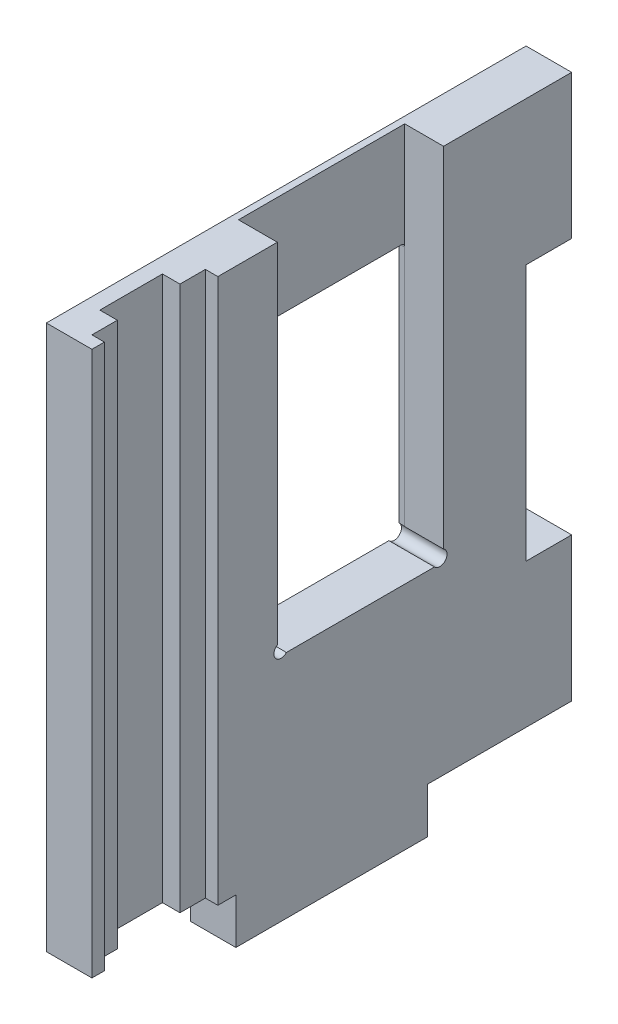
ISO-10303-21;
HEADER;
FILE_DESCRIPTION(('STEP AP214'),'2;1');
FILE_NAME('part.step','',(''),(''),'','','');
FILE_SCHEMA(('AUTOMOTIVE_DESIGN { 1 0 10303 214 1 1 1 1 }'));
ENDSEC;
DATA;
#1=APPLICATION_CONTEXT('core data for automotive mechanical design processes');
#2=APPLICATION_PROTOCOL_DEFINITION('international standard','automotive_design',2000,#1);
#3=PRODUCT_CONTEXT('',#1,'mechanical');
#4=PRODUCT('Part','Part','',(#3));
#5=PRODUCT_RELATED_PRODUCT_CATEGORY('part','',(#4));
#6=PRODUCT_DEFINITION_FORMATION('','',#4);
#7=PRODUCT_DEFINITION_CONTEXT('part definition',#1,'design');
#8=PRODUCT_DEFINITION('design','',#6,#7);
#9=PRODUCT_DEFINITION_SHAPE('','',#8);
#10=(LENGTH_UNIT() NAMED_UNIT(*) SI_UNIT(.MILLI.,.METRE.));
#11=(NAMED_UNIT(*) PLANE_ANGLE_UNIT() SI_UNIT($,.RADIAN.));
#12=(NAMED_UNIT(*) SI_UNIT($,.STERADIAN.) SOLID_ANGLE_UNIT());
#13=UNCERTAINTY_MEASURE_WITH_UNIT(LENGTH_MEASURE(1.E-05),#10,'distance_accuracy_value','');
#14=(GEOMETRIC_REPRESENTATION_CONTEXT(3) GLOBAL_UNCERTAINTY_ASSIGNED_CONTEXT((#13)) GLOBAL_UNIT_ASSIGNED_CONTEXT((#10,
#11,#12)) REPRESENTATION_CONTEXT('',''));
#15=CARTESIAN_POINT('',(0.,0.,0.));
#16=DIRECTION('',(0.,0.,1.));
#17=DIRECTION('',(1.,0.,0.));
#18=AXIS2_PLACEMENT_3D('',#15,#16,#17);
#19=CARTESIAN_POINT('',(9.50000000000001,-27.,22.7));
#20=DIRECTION('',(0.,0.,1.));
#21=DIRECTION('',(1.,0.,0.));
#22=AXIS2_PLACEMENT_3D('',#19,#20,#21);
#23=PLANE('',#22);
#24=DIRECTION('',(-1.,0.,0.));
#25=VECTOR('',#24,1.);
#26=CARTESIAN_POINT('',(9.50100000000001,-22.4314400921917,22.7));
#27=LINE('',#26,#25);
#28=CARTESIAN_POINT('',(9.50000000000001,-22.4314400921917,22.7));
#29=VERTEX_POINT('',#28);
#30=CARTESIAN_POINT('',(-6.69999999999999,-22.4314400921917,22.7));
#31=VERTEX_POINT('',#30);
#32=EDGE_CURVE('E523',#29,#31,#27,.T.);
#33=ORIENTED_EDGE('',*,*,#32,.T.);
#34=DIRECTION('',(0.,1.,0.));
#35=VECTOR('',#34,1.);
#36=CARTESIAN_POINT('',(-6.69999999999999,-27.,22.7));
#37=LINE('',#36,#35);
#38=CARTESIAN_POINT('',(-6.69999999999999,79.2639224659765,22.7));
#39=VERTEX_POINT('',#38);
#40=EDGE_CURVE('E292',#31,#39,#37,.T.);
#41=ORIENTED_EDGE('',*,*,#40,.T.);
#42=CARTESIAN_POINT('',(-6.69999999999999,123.,22.7));
#43=VERTEX_POINT('',#42);
#44=EDGE_CURVE('E294',#39,#43,#37,.T.);
#45=ORIENTED_EDGE('',*,*,#44,.T.);
#46=DIRECTION('',(1.,0.,0.));
#47=VECTOR('',#46,1.);
#48=CARTESIAN_POINT('',(9.50000000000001,123.,22.7));
#49=LINE('',#48,#47);
#50=CARTESIAN_POINT('',(9.50000000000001,123.,22.7));
#51=VERTEX_POINT('',#50);
#52=EDGE_CURVE('E283',#43,#51,#49,.T.);
#53=ORIENTED_EDGE('',*,*,#52,.T.);
#54=DIRECTION('',(0.,1.,0.));
#55=VECTOR('',#54,1.);
#56=CARTESIAN_POINT('',(9.50000000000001,-27.,22.7));
#57=LINE('',#56,#55);
#58=EDGE_CURVE('E289',#29,#51,#57,.T.);
#59=ORIENTED_EDGE('',*,*,#58,.F.);
#60=EDGE_LOOP('',(#33,#41,#45,#53,#59));
#61=FACE_BOUND('',#60,.T.);
#62=ADVANCED_FACE('F34',(#61),#23,.F.);
#63=CARTESIAN_POINT('',(0.,-27.,0.));
#64=DIRECTION('',(0.,-1.,0.));
#65=DIRECTION('',(0.,0.,-1.));
#66=AXIS2_PLACEMENT_3D('',#63,#64,#65);
#67=PLANE('',#66);
#68=DIRECTION('',(-1.,0.,0.));
#69=VECTOR('',#68,1.);
#70=CARTESIAN_POINT('',(9.50100000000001,-27.,18.9139320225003));
#71=LINE('',#70,#69);
#72=CARTESIAN_POINT('',(-9.5,-27.,18.9139320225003));
#73=VERTEX_POINT('',#72);
#74=CARTESIAN_POINT('',(9.5,-27.,18.9139320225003));
#75=VERTEX_POINT('',#74);
#76=EDGE_CURVE('E246',#73,#75,#71,.F.);
#77=ORIENTED_EDGE('',*,*,#76,.T.);
#78=DIRECTION('',(0.,0.,-1.));
#79=VECTOR('',#78,1.);
#80=CARTESIAN_POINT('',(9.5,-27.,-46.6));
#81=LINE('',#80,#79);
#82=CARTESIAN_POINT('',(9.5,-27.,-42.8139320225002));
#83=VERTEX_POINT('',#82);
#84=EDGE_CURVE('E281',#75,#83,#81,.T.);
#85=ORIENTED_EDGE('',*,*,#84,.T.);
#86=DIRECTION('',(-1.,0.,0.));
#87=VECTOR('',#86,1.);
#88=CARTESIAN_POINT('',(9.50100000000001,-27.,-42.8139320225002));
#89=LINE('',#88,#87);
#90=CARTESIAN_POINT('',(-9.5,-27.,-42.8139320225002));
#91=VERTEX_POINT('',#90);
#92=EDGE_CURVE('E269',#91,#83,#89,.F.);
#93=ORIENTED_EDGE('',*,*,#92,.F.);
#94=DIRECTION('',(0.,0.,1.));
#95=VECTOR('',#94,1.);
#96=CARTESIAN_POINT('',(-9.5,-27.,23.15));
#97=LINE('',#96,#95);
#98=EDGE_CURVE('E261',#91,#73,#97,.T.);
#99=ORIENTED_EDGE('',*,*,#98,.T.);
#100=EDGE_LOOP('',(#77,#85,#93,#99));
#101=FACE_BOUND('',#100,.T.);
#102=ADVANCED_FACE('F267',(#101),#67,.F.);
#103=CARTESIAN_POINT('',(-9.501,80.,23.15));
#104=DIRECTION('',(0.,0.,1.));
#105=DIRECTION('',(1.,0.,0.));
#106=AXIS2_PLACEMENT_3D('',#103,#104,#105);
#107=PLANE('',#106);
#108=DIRECTION('',(-1.,0.,0.));
#109=VECTOR('',#108,1.);
#110=CARTESIAN_POINT('',(9.50100000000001,-22.7639320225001,23.15));
#111=LINE('',#110,#109);
#112=CARTESIAN_POINT('',(-6.69999999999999,-22.7639320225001,23.15));
#113=VERTEX_POINT('',#112);
#114=CARTESIAN_POINT('',(-9.5,-22.7639320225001,23.15));
#115=VERTEX_POINT('',#114);
#116=EDGE_CURVE('E253',#113,#115,#111,.T.);
#117=ORIENTED_EDGE('',*,*,#116,.T.);
#118=DIRECTION('',(0.,1.,0.));
#119=VECTOR('',#118,1.);
#120=CARTESIAN_POINT('',(-9.5,80.,23.15));
#121=LINE('',#120,#119);
#122=CARTESIAN_POINT('',(-9.5,78.,23.15));
#123=VERTEX_POINT('',#122);
#124=EDGE_CURVE('E263',#115,#123,#121,.T.);
#125=ORIENTED_EDGE('',*,*,#124,.T.);
#126=DIRECTION('',(1.,0.,0.));
#127=VECTOR('',#126,1.);
#128=CARTESIAN_POINT('',(-6.69999999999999,78.,23.15));
#129=LINE('',#128,#127);
#130=CARTESIAN_POINT('',(-6.69999999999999,78.,23.15));
#131=VERTEX_POINT('',#130);
#132=EDGE_CURVE('E444',#123,#131,#129,.T.);
#133=ORIENTED_EDGE('',*,*,#132,.T.);
#134=DIRECTION('',(0.,-1.,0.));
#135=VECTOR('',#134,1.);
#136=CARTESIAN_POINT('',(-6.69999999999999,80.,23.15));
#137=LINE('',#136,#135);
#138=EDGE_CURVE('E497',#131,#113,#137,.T.);
#139=ORIENTED_EDGE('',*,*,#138,.T.);
#140=EDGE_LOOP('',(#117,#125,#133,#139));
#141=FACE_BOUND('',#140,.T.);
#142=ADVANCED_FACE('F548',(#141),#107,.F.);
#143=CARTESIAN_POINT('',(9.5,123.,100.));
#144=DIRECTION('',(0.,-1.,0.));
#145=DIRECTION('',(0.,0.,-1.));
#146=AXIS2_PLACEMENT_3D('',#143,#144,#145);
#147=PLANE('',#146);
#148=DIRECTION('',(0.,0.,1.));
#149=VECTOR('',#148,1.);
#150=CARTESIAN_POINT('',(9.5,123.,100.));
#151=LINE('',#150,#149);
#152=CARTESIAN_POINT('',(9.5,123.,47.5));
#153=VERTEX_POINT('',#152);
#154=EDGE_CURVE('E420',#51,#153,#151,.T.);
#155=ORIENTED_EDGE('',*,*,#154,.F.);
#156=ORIENTED_EDGE('',*,*,#52,.F.);
#157=DIRECTION('',(0.,0.,1.));
#158=VECTOR('',#157,1.);
#159=CARTESIAN_POINT('',(-6.7,123.,-46.6));
#160=LINE('',#159,#158);
#161=CARTESIAN_POINT('',(-6.7,123.,-46.6));
#162=VERTEX_POINT('',#161);
#163=EDGE_CURVE('E274',#162,#43,#160,.T.);
#164=ORIENTED_EDGE('',*,*,#163,.F.);
#165=DIRECTION('',(-1.,0.,0.));
#166=VECTOR('',#165,1.);
#167=CARTESIAN_POINT('',(9.5,123.,-46.6));
#168=LINE('',#167,#166);
#169=CARTESIAN_POINT('',(9.5,123.,-46.6));
#170=VERTEX_POINT('',#169);
#171=EDGE_CURVE('E270',#170,#162,#168,.T.);
#172=ORIENTED_EDGE('',*,*,#171,.F.);
#173=CARTESIAN_POINT('',(9.5,123.,-100.));
#174=VERTEX_POINT('',#173);
#175=EDGE_CURVE('E416',#174,#170,#151,.T.);
#176=ORIENTED_EDGE('',*,*,#175,.F.);
#177=DIRECTION('',(-1.,0.,0.));
#178=VECTOR('',#177,1.);
#179=CARTESIAN_POINT('',(9.5,123.,-100.));
#180=LINE('',#179,#178);
#181=CARTESIAN_POINT('',(-9.5,123.,-100.));
#182=VERTEX_POINT('',#181);
#183=EDGE_CURVE('E437',#174,#182,#180,.T.);
#184=ORIENTED_EDGE('',*,*,#183,.T.);
#185=DIRECTION('',(0.,0.,1.));
#186=VECTOR('',#185,1.);
#187=CARTESIAN_POINT('',(-9.5,123.,100.));
#188=LINE('',#187,#186);
#189=CARTESIAN_POINT('',(-9.5,123.,100.));
#190=VERTEX_POINT('',#189);
#191=EDGE_CURVE('E428',#182,#190,#188,.T.);
#192=ORIENTED_EDGE('',*,*,#191,.T.);
#193=DIRECTION('',(-1.,0.,0.));
#194=VECTOR('',#193,1.);
#195=CARTESIAN_POINT('',(9.5,123.,100.));
#196=LINE('',#195,#194);
#197=CARTESIAN_POINT('',(9.5,123.,100.));
#198=VERTEX_POINT('',#197);
#199=EDGE_CURVE('E425',#198,#190,#196,.T.);
#200=ORIENTED_EDGE('',*,*,#199,.F.);
#201=CARTESIAN_POINT('',(9.5,123.,94.8));
#202=VERTEX_POINT('',#201);
#203=EDGE_CURVE('E414',#202,#198,#151,.T.);
#204=ORIENTED_EDGE('',*,*,#203,.F.);
#205=DIRECTION('',(1.,0.,0.));
#206=VECTOR('',#205,1.);
#207=CARTESIAN_POINT('',(4.3,123.,94.8));
#208=LINE('',#207,#206);
#209=CARTESIAN_POINT('',(4.3,123.,94.8));
#210=VERTEX_POINT('',#209);
#211=EDGE_CURVE('E341',#210,#202,#208,.T.);
#212=ORIENTED_EDGE('',*,*,#211,.F.);
#213=DIRECTION('',(0.,0.,-1.));
#214=VECTOR('',#213,1.);
#215=CARTESIAN_POINT('',(4.3,123.,47.5));
#216=LINE('',#215,#214);
#217=CARTESIAN_POINT('',(4.3,123.,84.2));
#218=VERTEX_POINT('',#217);
#219=EDGE_CURVE('E331',#210,#218,#216,.T.);
#220=ORIENTED_EDGE('',*,*,#219,.T.);
#221=DIRECTION('',(1.,0.,0.));
#222=VECTOR('',#221,1.);
#223=CARTESIAN_POINT('',(-3.,123.,84.2));
#224=LINE('',#223,#222);
#225=CARTESIAN_POINT('',(-3.,123.,84.2));
#226=VERTEX_POINT('',#225);
#227=EDGE_CURVE('E317',#226,#218,#224,.T.);
#228=ORIENTED_EDGE('',*,*,#227,.F.);
#229=DIRECTION('',(0.,0.,-1.));
#230=VECTOR('',#229,1.);
#231=CARTESIAN_POINT('',(-3.,123.,84.2));
#232=LINE('',#231,#230);
#233=CARTESIAN_POINT('',(-3.,123.,58.1));
#234=VERTEX_POINT('',#233);
#235=EDGE_CURVE('E301',#226,#234,#232,.T.);
#236=ORIENTED_EDGE('',*,*,#235,.T.);
#237=DIRECTION('',(1.,0.,0.));
#238=VECTOR('',#237,1.);
#239=CARTESIAN_POINT('',(-3.,123.,58.1));
#240=LINE('',#239,#238);
#241=CARTESIAN_POINT('',(4.3,123.,58.1));
#242=VERTEX_POINT('',#241);
#243=EDGE_CURVE('E314',#234,#242,#240,.T.);
#244=ORIENTED_EDGE('',*,*,#243,.T.);
#245=CARTESIAN_POINT('',(4.3,123.,47.5));
#246=VERTEX_POINT('',#245);
#247=EDGE_CURVE('E330',#242,#246,#216,.T.);
#248=ORIENTED_EDGE('',*,*,#247,.T.);
#249=DIRECTION('',(1.,0.,0.));
#250=VECTOR('',#249,1.);
#251=CARTESIAN_POINT('',(4.3,123.,47.5));
#252=LINE('',#251,#250);
#253=EDGE_CURVE('E334',#246,#153,#252,.T.);
#254=ORIENTED_EDGE('',*,*,#253,.T.);
#255=EDGE_LOOP('',(#155,#156,#164,#172,#176,#184,#192,#200,#204,#212,#220,#228,#236,#244,#248,#254));
#256=FACE_BOUND('',#255,.T.);
#257=ADVANCED_FACE('F488',(#256),#147,.F.);
#258=CARTESIAN_POINT('',(-9.501,-104.,100.));
#259=DIRECTION('',(0.,-1.,0.));
#260=DIRECTION('',(0.,0.,-1.));
#261=AXIS2_PLACEMENT_3D('',#258,#259,#260);
#262=PLANE('',#261);
#263=DIRECTION('',(0.,0.,1.));
#264=VECTOR('',#263,1.);
#265=CARTESIAN_POINT('',(-3.,-104.,84.2000000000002));
#266=LINE('',#265,#264);
#267=CARTESIAN_POINT('',(-3.,-104.,58.1));
#268=VERTEX_POINT('',#267);
#269=CARTESIAN_POINT('',(-3.,-104.,84.2000000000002));
#270=VERTEX_POINT('',#269);
#271=EDGE_CURVE('E306',#268,#270,#266,.T.);
#272=ORIENTED_EDGE('',*,*,#271,.T.);
#273=DIRECTION('',(1.,0.,0.));
#274=VECTOR('',#273,1.);
#275=CARTESIAN_POINT('',(-3.,-104.,84.2000000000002));
#276=LINE('',#275,#274);
#277=CARTESIAN_POINT('',(4.3,-104.,84.2000000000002));
#278=VERTEX_POINT('',#277);
#279=EDGE_CURVE('E309',#270,#278,#276,.T.);
#280=ORIENTED_EDGE('',*,*,#279,.T.);
#281=DIRECTION('',(0.,0.,1.));
#282=VECTOR('',#281,1.);
#283=CARTESIAN_POINT('',(4.3,-104.,47.5000000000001));
#284=LINE('',#283,#282);
#285=CARTESIAN_POINT('',(4.3,-104.,94.8000000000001));
#286=VERTEX_POINT('',#285);
#287=EDGE_CURVE('E323',#278,#286,#284,.T.);
#288=ORIENTED_EDGE('',*,*,#287,.T.);
#289=DIRECTION('',(1.,0.,0.));
#290=VECTOR('',#289,1.);
#291=CARTESIAN_POINT('',(4.3,-104.,94.8000000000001));
#292=LINE('',#291,#290);
#293=CARTESIAN_POINT('',(9.5,-104.,94.8000000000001));
#294=VERTEX_POINT('',#293);
#295=EDGE_CURVE('E343',#286,#294,#292,.T.);
#296=ORIENTED_EDGE('',*,*,#295,.T.);
#297=DIRECTION('',(0.,0.,-1.));
#298=VECTOR('',#297,1.);
#299=CARTESIAN_POINT('',(9.5,-104.,100.));
#300=LINE('',#299,#298);
#301=CARTESIAN_POINT('',(9.5,-104.,100.));
#302=VERTEX_POINT('',#301);
#303=EDGE_CURVE('E358',#302,#294,#300,.T.);
#304=ORIENTED_EDGE('',*,*,#303,.F.);
#305=DIRECTION('',(1.,0.,0.));
#306=VECTOR('',#305,1.);
#307=CARTESIAN_POINT('',(-9.501,-104.,100.));
#308=LINE('',#307,#306);
#309=CARTESIAN_POINT('',(-9.5,-104.,100.));
#310=VERTEX_POINT('',#309);
#311=EDGE_CURVE('E362',#310,#302,#308,.T.);
#312=ORIENTED_EDGE('',*,*,#311,.F.);
#313=DIRECTION('',(0.,0.,1.));
#314=VECTOR('',#313,1.);
#315=CARTESIAN_POINT('',(-9.5,-104.,100.));
#316=LINE('',#315,#314);
#317=CARTESIAN_POINT('',(-9.5,-104.,40.));
#318=VERTEX_POINT('',#317);
#319=EDGE_CURVE('E351',#318,#310,#316,.T.);
#320=ORIENTED_EDGE('',*,*,#319,.F.);
#321=DIRECTION('',(1.,0.,0.));
#322=VECTOR('',#321,1.);
#323=CARTESIAN_POINT('',(-9.501,-104.,40.));
#324=LINE('',#323,#322);
#325=CARTESIAN_POINT('',(9.5,-104.,40.));
#326=VERTEX_POINT('',#325);
#327=EDGE_CURVE('E366',#318,#326,#324,.T.);
#328=ORIENTED_EDGE('',*,*,#327,.T.);
#329=CARTESIAN_POINT('',(9.5,-104.,47.5000000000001));
#330=VERTEX_POINT('',#329);
#331=EDGE_CURVE('E357',#330,#326,#300,.T.);
#332=ORIENTED_EDGE('',*,*,#331,.F.);
#333=DIRECTION('',(1.,0.,0.));
#334=VECTOR('',#333,1.);
#335=CARTESIAN_POINT('',(4.3,-104.,47.5000000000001));
#336=LINE('',#335,#334);
#337=CARTESIAN_POINT('',(4.3,-104.,47.5000000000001));
#338=VERTEX_POINT('',#337);
#339=EDGE_CURVE('E346',#338,#330,#336,.T.);
#340=ORIENTED_EDGE('',*,*,#339,.F.);
#341=CARTESIAN_POINT('',(4.3,-104.,58.1));
#342=VERTEX_POINT('',#341);
#343=EDGE_CURVE('E325',#338,#342,#284,.T.);
#344=ORIENTED_EDGE('',*,*,#343,.T.);
#345=DIRECTION('',(1.,0.,0.));
#346=VECTOR('',#345,1.);
#347=CARTESIAN_POINT('',(-3.,-104.,58.1));
#348=LINE('',#347,#346);
#349=EDGE_CURVE('E312',#268,#342,#348,.T.);
#350=ORIENTED_EDGE('',*,*,#349,.F.);
#351=EDGE_LOOP('',(#272,#280,#288,#296,#304,#312,#320,#328,#332,#340,#344,#350));
#352=FACE_BOUND('',#351,.T.);
#353=ADVANCED_FACE('F574',(#352),#262,.T.);
#354=CARTESIAN_POINT('',(4.3,0.,0.));
#355=DIRECTION('',(-1.,0.,0.));
#356=DIRECTION('',(0.,0.,1.));
#357=AXIS2_PLACEMENT_3D('',#354,#355,#356);
#358=PLANE('',#357);
#359=DIRECTION('',(0.,-1.,0.));
#360=VECTOR('',#359,1.);
#361=CARTESIAN_POINT('',(4.3,0.,84.2000000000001));
#362=LINE('',#361,#360);
#363=EDGE_CURVE('E442',#218,#278,#362,.T.);
#364=ORIENTED_EDGE('',*,*,#363,.F.);
#365=ORIENTED_EDGE('',*,*,#219,.F.);
#366=DIRECTION('',(0.,1.,0.));
#367=VECTOR('',#366,1.);
#368=CARTESIAN_POINT('',(4.3,123.,94.8));
#369=LINE('',#368,#367);
#370=EDGE_CURVE('E328',#286,#210,#369,.T.);
#371=ORIENTED_EDGE('',*,*,#370,.F.);
#372=ORIENTED_EDGE('',*,*,#287,.F.);
#373=EDGE_LOOP('',(#364,#365,#371,#372));
#374=FACE_BOUND('',#373,.T.);
#375=ADVANCED_FACE('F570',(#374),#358,.F.);
#376=DIRECTION('',(0.,1.,0.));
#377=VECTOR('',#376,1.);
#378=CARTESIAN_POINT('',(4.3,0.,58.1));
#379=LINE('',#378,#377);
#380=EDGE_CURVE('E440',#342,#242,#379,.T.);
#381=ORIENTED_EDGE('',*,*,#380,.F.);
#382=ORIENTED_EDGE('',*,*,#343,.F.);
#383=DIRECTION('',(0.,-1.,0.));
#384=VECTOR('',#383,1.);
#385=CARTESIAN_POINT('',(4.3,123.,47.5));
#386=LINE('',#385,#384);
#387=EDGE_CURVE('E320',#246,#338,#386,.T.);
#388=ORIENTED_EDGE('',*,*,#387,.F.);
#389=ORIENTED_EDGE('',*,*,#247,.F.);
#390=EDGE_LOOP('',(#381,#382,#388,#389));
#391=FACE_BOUND('',#390,.T.);
#392=ADVANCED_FACE('F573',(#391),#358,.F.);
#393=CARTESIAN_POINT('',(9.5,0.,0.));
#394=DIRECTION('',(1.,0.,0.));
#395=DIRECTION('',(0.,0.,-1.));
#396=AXIS2_PLACEMENT_3D('',#393,#394,#395);
#397=PLANE('',#396);
#398=ORIENTED_EDGE('',*,*,#84,.F.);
#399=CARTESIAN_POINT('',(9.5,-24.9999999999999,21.15));
#400=DIRECTION('',(1.,0.,0.));
#401=DIRECTION('',(0.,0.,-1.));
#402=AXIS2_PLACEMENT_3D('',#399,#400,#401);
#403=CIRCLE('',#402,3.);
#404=EDGE_CURVE('E249',#29,#75,#403,.T.);
#405=ORIENTED_EDGE('',*,*,#404,.F.);
#406=ORIENTED_EDGE('',*,*,#58,.T.);
#407=ORIENTED_EDGE('',*,*,#154,.T.);
#408=DIRECTION('',(0.,-1.,0.));
#409=VECTOR('',#408,1.);
#410=CARTESIAN_POINT('',(9.5,123.,47.5));
#411=LINE('',#410,#409);
#412=EDGE_CURVE('E319',#153,#330,#411,.T.);
#413=ORIENTED_EDGE('',*,*,#412,.T.);
#414=ORIENTED_EDGE('',*,*,#331,.T.);
#415=DIRECTION('',(0.,-1.,0.));
#416=VECTOR('',#415,1.);
#417=CARTESIAN_POINT('',(9.5,-123.,40.));
#418=LINE('',#417,#416);
#419=CARTESIAN_POINT('',(9.5,-123.,40.));
#420=VERTEX_POINT('',#419);
#421=EDGE_CURVE('E354',#326,#420,#418,.T.);
#422=ORIENTED_EDGE('',*,*,#421,.T.);
#423=DIRECTION('',(0.,0.,-1.));
#424=VECTOR('',#423,1.);
#425=CARTESIAN_POINT('',(9.5,-123.,100.));
#426=LINE('',#425,#424);
#427=CARTESIAN_POINT('',(9.5,-123.,-40.));
#428=VERTEX_POINT('',#427);
#429=EDGE_CURVE('E423',#420,#428,#426,.T.);
#430=ORIENTED_EDGE('',*,*,#429,.T.);
#431=DIRECTION('',(0.,-1.,0.));
#432=VECTOR('',#431,1.);
#433=CARTESIAN_POINT('',(9.5,-123.,-40.));
#434=LINE('',#433,#432);
#435=CARTESIAN_POINT('',(9.5,-104.,-40.));
#436=VERTEX_POINT('',#435);
#437=EDGE_CURVE('E374',#436,#428,#434,.T.);
#438=ORIENTED_EDGE('',*,*,#437,.F.);
#439=DIRECTION('',(0.,0.,1.));
#440=VECTOR('',#439,1.);
#441=CARTESIAN_POINT('',(9.5,-104.,-100.));
#442=LINE('',#441,#440);
#443=CARTESIAN_POINT('',(9.5,-104.,-100.));
#444=VERTEX_POINT('',#443);
#445=EDGE_CURVE('E371',#444,#436,#442,.T.);
#446=ORIENTED_EDGE('',*,*,#445,.F.);
#447=DIRECTION('',(0.,1.,0.));
#448=VECTOR('',#447,1.);
#449=CARTESIAN_POINT('',(9.5,123.,-100.));
#450=LINE('',#449,#448);
#451=CARTESIAN_POINT('',(9.5,-44.,-100.));
#452=VERTEX_POINT('',#451);
#453=EDGE_CURVE('E412',#444,#452,#450,.T.);
#454=ORIENTED_EDGE('',*,*,#453,.T.);
#455=DIRECTION('',(0.,0.,-1.));
#456=VECTOR('',#455,1.);
#457=CARTESIAN_POINT('',(9.5,-44.,-100.));
#458=LINE('',#457,#456);
#459=CARTESIAN_POINT('',(9.5,-44.,-81.));
#460=VERTEX_POINT('',#459);
#461=EDGE_CURVE('E397',#460,#452,#458,.T.);
#462=ORIENTED_EDGE('',*,*,#461,.F.);
#463=DIRECTION('',(0.,-1.,0.));
#464=VECTOR('',#463,1.);
#465=CARTESIAN_POINT('',(9.5,63.,-81.));
#466=LINE('',#465,#464);
#467=CARTESIAN_POINT('',(9.5,63.,-81.));
#468=VERTEX_POINT('',#467);
#469=EDGE_CURVE('E394',#468,#460,#466,.T.);
#470=ORIENTED_EDGE('',*,*,#469,.F.);
#471=DIRECTION('',(0.,0.,1.));
#472=VECTOR('',#471,1.);
#473=CARTESIAN_POINT('',(9.5,63.,-100.));
#474=LINE('',#473,#472);
#475=CARTESIAN_POINT('',(9.5,63.,-100.));
#476=VERTEX_POINT('',#475);
#477=EDGE_CURVE('E391',#476,#468,#474,.T.);
#478=ORIENTED_EDGE('',*,*,#477,.F.);
#479=EDGE_CURVE('E415',#476,#174,#450,.T.);
#480=ORIENTED_EDGE('',*,*,#479,.T.);
#481=ORIENTED_EDGE('',*,*,#175,.T.);
#482=DIRECTION('',(0.,1.,0.));
#483=VECTOR('',#482,1.);
#484=CARTESIAN_POINT('',(9.5,-27.,-46.6));
#485=LINE('',#484,#483);
#486=CARTESIAN_POINT('',(9.5,-22.4314400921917,-46.6));
#487=VERTEX_POINT('',#486);
#488=EDGE_CURVE('E282',#487,#170,#485,.T.);
#489=ORIENTED_EDGE('',*,*,#488,.F.);
#490=CARTESIAN_POINT('',(9.5,-24.9999999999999,-45.05));
#491=DIRECTION('',(1.,0.,0.));
#492=DIRECTION('',(0.,0.,-1.));
#493=AXIS2_PLACEMENT_3D('',#490,#491,#492);
#494=CIRCLE('',#493,3.);
#495=EDGE_CURVE('E513',#487,#83,#494,.F.);
#496=ORIENTED_EDGE('',*,*,#495,.T.);
#497=EDGE_LOOP('',(#398,#405,#406,#407,#413,#414,#422,#430,#438,#446,#454,#462,#470,#478,#480,
#481,#489,#496));
#498=FACE_BOUND('',#497,.T.);
#499=ADVANCED_FACE('F532',(#498),#397,.T.);
#500=ORIENTED_EDGE('',*,*,#303,.T.);
#501=DIRECTION('',(0.,1.,0.));
#502=VECTOR('',#501,1.);
#503=CARTESIAN_POINT('',(9.5,123.,94.8));
#504=LINE('',#503,#502);
#505=EDGE_CURVE('E324',#294,#202,#504,.T.);
#506=ORIENTED_EDGE('',*,*,#505,.T.);
#507=ORIENTED_EDGE('',*,*,#203,.T.);
#508=DIRECTION('',(0.,-1.,0.));
#509=VECTOR('',#508,1.);
#510=CARTESIAN_POINT('',(9.5,123.,100.));
#511=LINE('',#510,#509);
#512=EDGE_CURVE('E419',#198,#302,#511,.T.);
#513=ORIENTED_EDGE('',*,*,#512,.T.);
#514=EDGE_LOOP('',(#500,#506,#507,#513));
#515=FACE_BOUND('',#514,.T.);
#516=ADVANCED_FACE('F613',(#515),#397,.T.);
#517=CARTESIAN_POINT('',(9.5,123.,100.));
#518=DIRECTION('',(0.,0.,-1.));
#519=DIRECTION('',(0.,1.,0.));
#520=AXIS2_PLACEMENT_3D('',#517,#518,#519);
#521=PLANE('',#520);
#522=ORIENTED_EDGE('',*,*,#311,.T.);
#523=ORIENTED_EDGE('',*,*,#512,.F.);
#524=ORIENTED_EDGE('',*,*,#199,.T.);
#525=DIRECTION('',(0.,-1.,0.));
#526=VECTOR('',#525,1.);
#527=CARTESIAN_POINT('',(-9.5,123.,100.));
#528=LINE('',#527,#526);
#529=EDGE_CURVE('E430',#190,#310,#528,.T.);
#530=ORIENTED_EDGE('',*,*,#529,.T.);
#531=EDGE_LOOP('',(#522,#523,#524,#530));
#532=FACE_BOUND('',#531,.T.);
#533=ADVANCED_FACE('F620',(#532),#521,.F.);
#534=CARTESIAN_POINT('',(9.5,-123.,100.));
#535=DIRECTION('',(0.,1.,0.));
#536=DIRECTION('',(0.,0.,1.));
#537=AXIS2_PLACEMENT_3D('',#534,#535,#536);
#538=PLANE('',#537);
#539=DIRECTION('',(1.,0.,0.));
#540=VECTOR('',#539,1.);
#541=CARTESIAN_POINT('',(-9.501,-123.,40.));
#542=LINE('',#541,#540);
#543=CARTESIAN_POINT('',(-9.5,-123.,40.));
#544=VERTEX_POINT('',#543);
#545=EDGE_CURVE('E361',#544,#420,#542,.T.);
#546=ORIENTED_EDGE('',*,*,#545,.F.);
#547=DIRECTION('',(0.,0.,-1.));
#548=VECTOR('',#547,1.);
#549=CARTESIAN_POINT('',(-9.5,-123.,100.));
#550=LINE('',#549,#548);
#551=CARTESIAN_POINT('',(-9.5,-123.,-40.));
#552=VERTEX_POINT('',#551);
#553=EDGE_CURVE('E433',#544,#552,#550,.T.);
#554=ORIENTED_EDGE('',*,*,#553,.T.);
#555=DIRECTION('',(1.,0.,0.));
#556=VECTOR('',#555,1.);
#557=CARTESIAN_POINT('',(-9.501,-123.,-40.));
#558=LINE('',#557,#556);
#559=EDGE_CURVE('E378',#552,#428,#558,.T.);
#560=ORIENTED_EDGE('',*,*,#559,.T.);
#561=ORIENTED_EDGE('',*,*,#429,.F.);
#562=EDGE_LOOP('',(#546,#554,#560,#561));
#563=FACE_BOUND('',#562,.T.);
#564=ADVANCED_FACE('F617',(#563),#538,.F.);
#565=CARTESIAN_POINT('',(-9.5,0.,0.));
#566=DIRECTION('',(1.,0.,0.));
#567=DIRECTION('',(0.,0.,-1.));
#568=AXIS2_PLACEMENT_3D('',#565,#566,#567);
#569=PLANE('',#568);
#570=CARTESIAN_POINT('',(-9.5,-24.9999999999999,21.15));
#571=DIRECTION('',(1.,0.,0.));
#572=DIRECTION('',(0.,0.,-1.));
#573=AXIS2_PLACEMENT_3D('',#570,#571,#572);
#574=CIRCLE('',#573,3.);
#575=EDGE_CURVE('E49',#115,#73,#574,.T.);
#576=ORIENTED_EDGE('',*,*,#575,.T.);
#577=ORIENTED_EDGE('',*,*,#98,.F.);
#578=CARTESIAN_POINT('',(-9.5,-24.9999999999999,-45.05));
#579=DIRECTION('',(-1.,0.,0.));
#580=DIRECTION('',(0.,0.,1.));
#581=AXIS2_PLACEMENT_3D('',#578,#579,#580);
#582=CIRCLE('',#581,3.);
#583=CARTESIAN_POINT('',(-9.5,-22.7639320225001,-47.05));
#584=VERTEX_POINT('',#583);
#585=EDGE_CURVE('E521',#584,#91,#582,.T.);
#586=ORIENTED_EDGE('',*,*,#585,.F.);
#587=DIRECTION('',(0.,-1.,0.));
#588=VECTOR('',#587,1.);
#589=CARTESIAN_POINT('',(-9.5,80.0000000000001,-47.0499999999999));
#590=LINE('',#589,#588);
#591=CARTESIAN_POINT('',(-9.5,78.0000000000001,-47.0499999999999));
#592=VERTEX_POINT('',#591);
#593=EDGE_CURVE('E509',#592,#584,#590,.T.);
#594=ORIENTED_EDGE('',*,*,#593,.F.);
#595=CARTESIAN_POINT('',(-9.5,78.0000000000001,-45.0499999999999));
#596=DIRECTION('',(1.,0.,0.));
#597=DIRECTION('',(0.,0.,-1.));
#598=AXIS2_PLACEMENT_3D('',#595,#596,#597);
#599=CIRCLE('',#598,2.);
#600=CARTESIAN_POINT('',(-9.5,80.0000000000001,-45.0499999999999));
#601=VERTEX_POINT('',#600);
#602=EDGE_CURVE('E11',#592,#601,#599,.T.);
#603=ORIENTED_EDGE('',*,*,#602,.T.);
#604=DIRECTION('',(0.,0.,-1.));
#605=VECTOR('',#604,1.);
#606=CARTESIAN_POINT('',(-9.5,80.,23.15));
#607=LINE('',#606,#605);
#608=CARTESIAN_POINT('',(-9.5,80.,21.15));
#609=VERTEX_POINT('',#608);
#610=EDGE_CURVE('E507',#609,#601,#607,.T.);
#611=ORIENTED_EDGE('',*,*,#610,.F.);
#612=CARTESIAN_POINT('',(-9.5,78.,21.15));
#613=DIRECTION('',(1.,0.,0.));
#614=DIRECTION('',(0.,0.,-1.));
#615=AXIS2_PLACEMENT_3D('',#612,#613,#614);
#616=CIRCLE('',#615,2.);
#617=EDGE_CURVE('E462',#609,#123,#616,.T.);
#618=ORIENTED_EDGE('',*,*,#617,.T.);
#619=ORIENTED_EDGE('',*,*,#124,.F.);
#620=EDGE_LOOP('',(#576,#577,#586,#594,#603,#611,#618,#619));
#621=FACE_BOUND('',#620,.T.);
#622=ORIENTED_EDGE('',*,*,#319,.T.);
#623=ORIENTED_EDGE('',*,*,#529,.F.);
#624=ORIENTED_EDGE('',*,*,#191,.F.);
#625=DIRECTION('',(0.,1.,0.));
#626=VECTOR('',#625,1.);
#627=CARTESIAN_POINT('',(-9.5,123.,-100.));
#628=LINE('',#627,#626);
#629=CARTESIAN_POINT('',(-9.5,63.,-100.));
#630=VERTEX_POINT('',#629);
#631=EDGE_CURVE('E411',#630,#182,#628,.T.);
#632=ORIENTED_EDGE('',*,*,#631,.F.);
#633=DIRECTION('',(0.,0.,-1.));
#634=VECTOR('',#633,1.);
#635=CARTESIAN_POINT('',(-9.5,63.,-100.));
#636=LINE('',#635,#634);
#637=CARTESIAN_POINT('',(-9.5,63.,-81.));
#638=VERTEX_POINT('',#637);
#639=EDGE_CURVE('E404',#638,#630,#636,.T.);
#640=ORIENTED_EDGE('',*,*,#639,.F.);
#641=DIRECTION('',(0.,1.,0.));
#642=VECTOR('',#641,1.);
#643=CARTESIAN_POINT('',(-9.5,63.,-81.));
#644=LINE('',#643,#642);
#645=CARTESIAN_POINT('',(-9.5,-44.,-81.));
#646=VERTEX_POINT('',#645);
#647=EDGE_CURVE('E386',#646,#638,#644,.T.);
#648=ORIENTED_EDGE('',*,*,#647,.F.);
#649=DIRECTION('',(0.,0.,1.));
#650=VECTOR('',#649,1.);
#651=CARTESIAN_POINT('',(-9.5,-44.,-100.));
#652=LINE('',#651,#650);
#653=CARTESIAN_POINT('',(-9.5,-44.,-100.));
#654=VERTEX_POINT('',#653);
#655=EDGE_CURVE('E388',#654,#646,#652,.T.);
#656=ORIENTED_EDGE('',*,*,#655,.F.);
#657=CARTESIAN_POINT('',(-9.5,-104.,-100.));
#658=VERTEX_POINT('',#657);
#659=EDGE_CURVE('E426',#658,#654,#628,.T.);
#660=ORIENTED_EDGE('',*,*,#659,.F.);
#661=DIRECTION('',(0.,0.,-1.));
#662=VECTOR('',#661,1.);
#663=CARTESIAN_POINT('',(-9.5,-104.,-100.));
#664=LINE('',#663,#662);
#665=CARTESIAN_POINT('',(-9.5,-104.,-40.));
#666=VERTEX_POINT('',#665);
#667=EDGE_CURVE('E381',#666,#658,#664,.T.);
#668=ORIENTED_EDGE('',*,*,#667,.F.);
#669=DIRECTION('',(0.,1.,0.));
#670=VECTOR('',#669,1.);
#671=CARTESIAN_POINT('',(-9.5,-123.,-40.));
#672=LINE('',#671,#670);
#673=EDGE_CURVE('E365',#552,#666,#672,.T.);
#674=ORIENTED_EDGE('',*,*,#673,.F.);
#675=ORIENTED_EDGE('',*,*,#553,.F.);
#676=DIRECTION('',(0.,1.,0.));
#677=VECTOR('',#676,1.);
#678=CARTESIAN_POINT('',(-9.5,-123.,40.));
#679=LINE('',#678,#677);
#680=EDGE_CURVE('E348',#544,#318,#679,.T.);
#681=ORIENTED_EDGE('',*,*,#680,.T.);
#682=EDGE_LOOP('',(#622,#623,#624,#632,#640,#648,#656,#660,#668,#674,#675,#681));
#683=FACE_BOUND('',#682,.T.);
#684=ADVANCED_FACE('F258',(#621,#683),#569,.F.);
#685=CARTESIAN_POINT('',(9.5,123.,-100.));
#686=DIRECTION('',(0.,0.,1.));
#687=DIRECTION('',(0.,-1.,0.));
#688=AXIS2_PLACEMENT_3D('',#685,#686,#687);
#689=PLANE('',#688);
#690=ORIENTED_EDGE('',*,*,#453,.F.);
#691=DIRECTION('',(1.,0.,0.));
#692=VECTOR('',#691,1.);
#693=CARTESIAN_POINT('',(-9.501,-104.,-100.));
#694=LINE('',#693,#692);
#695=EDGE_CURVE('E377',#658,#444,#694,.T.);
#696=ORIENTED_EDGE('',*,*,#695,.F.);
#697=ORIENTED_EDGE('',*,*,#659,.T.);
#698=DIRECTION('',(1.,0.,0.));
#699=VECTOR('',#698,1.);
#700=CARTESIAN_POINT('',(-9.501,-44.,-100.));
#701=LINE('',#700,#699);
#702=EDGE_CURVE('E401',#654,#452,#701,.T.);
#703=ORIENTED_EDGE('',*,*,#702,.T.);
#704=EDGE_LOOP('',(#690,#696,#697,#703));
#705=FACE_BOUND('',#704,.T.);
#706=ADVANCED_FACE('F616',(#705),#689,.F.);
#707=ORIENTED_EDGE('',*,*,#479,.F.);
#708=DIRECTION('',(1.,0.,0.));
#709=VECTOR('',#708,1.);
#710=CARTESIAN_POINT('',(-9.501,63.,-100.));
#711=LINE('',#710,#709);
#712=EDGE_CURVE('E400',#630,#476,#711,.T.);
#713=ORIENTED_EDGE('',*,*,#712,.F.);
#714=ORIENTED_EDGE('',*,*,#631,.T.);
#715=ORIENTED_EDGE('',*,*,#183,.F.);
#716=EDGE_LOOP('',(#707,#713,#714,#715));
#717=FACE_BOUND('',#716,.T.);
#718=ADVANCED_FACE('F603',(#717),#689,.F.);
#719=CARTESIAN_POINT('',(-9.501,-44.,-100.));
#720=DIRECTION('',(0.,-1.,0.));
#721=DIRECTION('',(0.,0.,-1.));
#722=AXIS2_PLACEMENT_3D('',#719,#720,#721);
#723=PLANE('',#722);
#724=ORIENTED_EDGE('',*,*,#655,.T.);
#725=DIRECTION('',(1.,0.,0.));
#726=VECTOR('',#725,1.);
#727=CARTESIAN_POINT('',(-9.501,-44.,-81.));
#728=LINE('',#727,#726);
#729=EDGE_CURVE('E405',#646,#460,#728,.T.);
#730=ORIENTED_EDGE('',*,*,#729,.T.);
#731=ORIENTED_EDGE('',*,*,#461,.T.);
#732=ORIENTED_EDGE('',*,*,#702,.F.);
#733=EDGE_LOOP('',(#724,#730,#731,#732));
#734=FACE_BOUND('',#733,.T.);
#735=ADVANCED_FACE('F599',(#734),#723,.F.);
#736=CARTESIAN_POINT('',(-9.501,63.,-81.));
#737=DIRECTION('',(0.,0.,1.));
#738=DIRECTION('',(0.,-1.,0.));
#739=AXIS2_PLACEMENT_3D('',#736,#737,#738);
#740=PLANE('',#739);
#741=ORIENTED_EDGE('',*,*,#647,.T.);
#742=DIRECTION('',(1.,0.,0.));
#743=VECTOR('',#742,1.);
#744=CARTESIAN_POINT('',(-9.501,63.,-81.));
#745=LINE('',#744,#743);
#746=EDGE_CURVE('E407',#638,#468,#745,.T.);
#747=ORIENTED_EDGE('',*,*,#746,.T.);
#748=ORIENTED_EDGE('',*,*,#469,.T.);
#749=ORIENTED_EDGE('',*,*,#729,.F.);
#750=EDGE_LOOP('',(#741,#747,#748,#749));
#751=FACE_BOUND('',#750,.T.);
#752=ADVANCED_FACE('F602',(#751),#740,.F.);
#753=CARTESIAN_POINT('',(-9.501,63.,-100.));
#754=DIRECTION('',(0.,1.,0.));
#755=DIRECTION('',(0.,0.,1.));
#756=AXIS2_PLACEMENT_3D('',#753,#754,#755);
#757=PLANE('',#756);
#758=ORIENTED_EDGE('',*,*,#639,.T.);
#759=ORIENTED_EDGE('',*,*,#712,.T.);
#760=ORIENTED_EDGE('',*,*,#477,.T.);
#761=ORIENTED_EDGE('',*,*,#746,.F.);
#762=EDGE_LOOP('',(#758,#759,#760,#761));
#763=FACE_BOUND('',#762,.T.);
#764=ADVANCED_FACE('F594',(#763),#757,.F.);
#765=CARTESIAN_POINT('',(-9.501,-123.,-40.));
#766=DIRECTION('',(0.,0.,1.));
#767=DIRECTION('',(1.,0.,0.));
#768=AXIS2_PLACEMENT_3D('',#765,#766,#767);
#769=PLANE('',#768);
#770=ORIENTED_EDGE('',*,*,#673,.T.);
#771=DIRECTION('',(1.,0.,0.));
#772=VECTOR('',#771,1.);
#773=CARTESIAN_POINT('',(-9.501,-104.,-40.));
#774=LINE('',#773,#772);
#775=EDGE_CURVE('E382',#666,#436,#774,.T.);
#776=ORIENTED_EDGE('',*,*,#775,.T.);
#777=ORIENTED_EDGE('',*,*,#437,.T.);
#778=ORIENTED_EDGE('',*,*,#559,.F.);
#779=EDGE_LOOP('',(#770,#776,#777,#778));
#780=FACE_BOUND('',#779,.T.);
#781=ADVANCED_FACE('F591',(#780),#769,.F.);
#782=CARTESIAN_POINT('',(-9.501,-104.,-100.));
#783=DIRECTION('',(0.,1.,0.));
#784=DIRECTION('',(0.,0.,1.));
#785=AXIS2_PLACEMENT_3D('',#782,#783,#784);
#786=PLANE('',#785);
#787=ORIENTED_EDGE('',*,*,#667,.T.);
#788=ORIENTED_EDGE('',*,*,#695,.T.);
#789=ORIENTED_EDGE('',*,*,#445,.T.);
#790=ORIENTED_EDGE('',*,*,#775,.F.);
#791=EDGE_LOOP('',(#787,#788,#789,#790));
#792=FACE_BOUND('',#791,.T.);
#793=ADVANCED_FACE('F589',(#792),#786,.F.);
#794=CARTESIAN_POINT('',(-9.501,-123.,40.));
#795=DIRECTION('',(0.,0.,1.));
#796=DIRECTION('',(1.,0.,0.));
#797=AXIS2_PLACEMENT_3D('',#794,#795,#796);
#798=PLANE('',#797);
#799=ORIENTED_EDGE('',*,*,#545,.T.);
#800=ORIENTED_EDGE('',*,*,#421,.F.);
#801=ORIENTED_EDGE('',*,*,#327,.F.);
#802=ORIENTED_EDGE('',*,*,#680,.F.);
#803=EDGE_LOOP('',(#799,#800,#801,#802));
#804=FACE_BOUND('',#803,.T.);
#805=ADVANCED_FACE('F582',(#804),#798,.T.);
#806=CARTESIAN_POINT('',(4.3,123.,47.5));
#807=DIRECTION('',(0.,0.,1.));
#808=DIRECTION('',(0.,-1.,0.));
#809=AXIS2_PLACEMENT_3D('',#806,#807,#808);
#810=PLANE('',#809);
#811=ORIENTED_EDGE('',*,*,#412,.F.);
#812=ORIENTED_EDGE('',*,*,#253,.F.);
#813=ORIENTED_EDGE('',*,*,#387,.T.);
#814=ORIENTED_EDGE('',*,*,#339,.T.);
#815=EDGE_LOOP('',(#811,#812,#813,#814));
#816=FACE_BOUND('',#815,.T.);
#817=ADVANCED_FACE('F578',(#816),#810,.T.);
#818=CARTESIAN_POINT('',(4.3,123.,94.8));
#819=DIRECTION('',(0.,0.,-1.));
#820=DIRECTION('',(0.,1.,0.));
#821=AXIS2_PLACEMENT_3D('',#818,#819,#820);
#822=PLANE('',#821);
#823=ORIENTED_EDGE('',*,*,#505,.F.);
#824=ORIENTED_EDGE('',*,*,#295,.F.);
#825=ORIENTED_EDGE('',*,*,#370,.T.);
#826=ORIENTED_EDGE('',*,*,#211,.T.);
#827=EDGE_LOOP('',(#823,#824,#825,#826));
#828=FACE_BOUND('',#827,.T.);
#829=ADVANCED_FACE('F568',(#828),#822,.T.);
#830=CARTESIAN_POINT('',(-3.,123.,84.2));
#831=DIRECTION('',(0.,0.,-1.));
#832=DIRECTION('',(0.,1.,0.));
#833=AXIS2_PLACEMENT_3D('',#830,#831,#832);
#834=PLANE('',#833);
#835=ORIENTED_EDGE('',*,*,#363,.T.);
#836=ORIENTED_EDGE('',*,*,#279,.F.);
#837=DIRECTION('',(0.,1.,0.));
#838=VECTOR('',#837,1.);
#839=CARTESIAN_POINT('',(-3.,123.,84.2));
#840=LINE('',#839,#838);
#841=EDGE_CURVE('E291',#270,#226,#840,.T.);
#842=ORIENTED_EDGE('',*,*,#841,.T.);
#843=ORIENTED_EDGE('',*,*,#227,.T.);
#844=EDGE_LOOP('',(#835,#836,#842,#843));
#845=FACE_BOUND('',#844,.T.);
#846=ADVANCED_FACE('F564',(#845),#834,.T.);
#847=CARTESIAN_POINT('',(-3.,123.,58.1));
#848=DIRECTION('',(0.,0.,1.));
#849=DIRECTION('',(0.,-1.,0.));
#850=AXIS2_PLACEMENT_3D('',#847,#848,#849);
#851=PLANE('',#850);
#852=ORIENTED_EDGE('',*,*,#380,.T.);
#853=ORIENTED_EDGE('',*,*,#243,.F.);
#854=DIRECTION('',(0.,-1.,0.));
#855=VECTOR('',#854,1.);
#856=CARTESIAN_POINT('',(-3.,123.,58.1));
#857=LINE('',#856,#855);
#858=EDGE_CURVE('E304',#234,#268,#857,.T.);
#859=ORIENTED_EDGE('',*,*,#858,.T.);
#860=ORIENTED_EDGE('',*,*,#349,.T.);
#861=EDGE_LOOP('',(#852,#853,#859,#860));
#862=FACE_BOUND('',#861,.T.);
#863=ADVANCED_FACE('F560',(#862),#851,.T.);
#864=CARTESIAN_POINT('',(-3.,0.,0.));
#865=DIRECTION('',(1.,0.,0.));
#866=DIRECTION('',(0.,0.,-1.));
#867=AXIS2_PLACEMENT_3D('',#864,#865,#866);
#868=PLANE('',#867);
#869=ORIENTED_EDGE('',*,*,#841,.F.);
#870=ORIENTED_EDGE('',*,*,#271,.F.);
#871=ORIENTED_EDGE('',*,*,#858,.F.);
#872=ORIENTED_EDGE('',*,*,#235,.F.);
#873=EDGE_LOOP('',(#869,#870,#871,#872));
#874=FACE_BOUND('',#873,.T.);
#875=ADVANCED_FACE('F555',(#874),#868,.T.);
#876=CARTESIAN_POINT('',(-6.7,-27.,-46.6));
#877=DIRECTION('',(-1.,0.,0.));
#878=DIRECTION('',(0.,0.,1.));
#879=AXIS2_PLACEMENT_3D('',#876,#877,#878);
#880=PLANE('',#879);
#881=ORIENTED_EDGE('',*,*,#44,.F.);
#882=CARTESIAN_POINT('',(-6.69999999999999,78.,21.15));
#883=DIRECTION('',(-1.,0.,0.));
#884=DIRECTION('',(0.,0.,1.));
#885=AXIS2_PLACEMENT_3D('',#882,#883,#884);
#886=CIRCLE('',#885,2.);
#887=CARTESIAN_POINT('',(-6.69999999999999,80.,21.15));
#888=VERTEX_POINT('',#887);
#889=EDGE_CURVE('E460',#39,#888,#886,.T.);
#890=ORIENTED_EDGE('',*,*,#889,.T.);
#891=DIRECTION('',(0.,0.,1.));
#892=VECTOR('',#891,1.);
#893=CARTESIAN_POINT('',(-6.69999999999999,80.,23.15));
#894=LINE('',#893,#892);
#895=CARTESIAN_POINT('',(-6.7,80.0000000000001,-45.0499999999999));
#896=VERTEX_POINT('',#895);
#897=EDGE_CURVE('E271',#896,#888,#894,.T.);
#898=ORIENTED_EDGE('',*,*,#897,.F.);
#899=CARTESIAN_POINT('',(-6.7,78.0000000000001,-45.0499999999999));
#900=DIRECTION('',(-1.,0.,0.));
#901=DIRECTION('',(0.,0.,1.));
#902=AXIS2_PLACEMENT_3D('',#899,#900,#901);
#903=CIRCLE('',#902,2.);
#904=CARTESIAN_POINT('',(-6.7,79.2639224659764,-46.6));
#905=VERTEX_POINT('',#904);
#906=EDGE_CURVE('E42',#896,#905,#903,.T.);
#907=ORIENTED_EDGE('',*,*,#906,.T.);
#908=DIRECTION('',(0.,1.,0.));
#909=VECTOR('',#908,1.);
#910=CARTESIAN_POINT('',(-6.7,-27.,-46.6));
#911=LINE('',#910,#909);
#912=EDGE_CURVE('E297',#905,#162,#911,.T.);
#913=ORIENTED_EDGE('',*,*,#912,.T.);
#914=ORIENTED_EDGE('',*,*,#163,.T.);
#915=EDGE_LOOP('',(#881,#890,#898,#907,#913,#914));
#916=FACE_BOUND('',#915,.T.);
#917=ADVANCED_FACE('F468',(#916),#880,.F.);
#918=CARTESIAN_POINT('',(9.5,-27.,-46.6));
#919=DIRECTION('',(0.,0.,-1.));
#920=DIRECTION('',(-1.,0.,0.));
#921=AXIS2_PLACEMENT_3D('',#918,#919,#920);
#922=PLANE('',#921);
#923=CARTESIAN_POINT('',(-6.7,-22.4314400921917,-46.6));
#924=VERTEX_POINT('',#923);
#925=EDGE_CURVE('E295',#924,#905,#911,.T.);
#926=ORIENTED_EDGE('',*,*,#925,.F.);
#927=DIRECTION('',(-1.,0.,0.));
#928=VECTOR('',#927,1.);
#929=CARTESIAN_POINT('',(9.50100000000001,-22.4314400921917,-46.6));
#930=LINE('',#929,#928);
#931=EDGE_CURVE('E529',#487,#924,#930,.T.);
#932=ORIENTED_EDGE('',*,*,#931,.F.);
#933=ORIENTED_EDGE('',*,*,#488,.T.);
#934=ORIENTED_EDGE('',*,*,#171,.T.);
#935=ORIENTED_EDGE('',*,*,#912,.F.);
#936=EDGE_LOOP('',(#926,#932,#933,#934,#935));
#937=FACE_BOUND('',#936,.T.);
#938=ADVANCED_FACE('F480',(#937),#922,.F.);
#939=CARTESIAN_POINT('',(-6.69999999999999,0.,0.));
#940=DIRECTION('',(1.,0.,0.));
#941=DIRECTION('',(0.,0.,-1.));
#942=AXIS2_PLACEMENT_3D('',#939,#940,#941);
#943=PLANE('',#942);
#944=CARTESIAN_POINT('',(-6.69999999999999,-24.9999999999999,21.15));
#945=DIRECTION('',(1.,0.,0.));
#946=DIRECTION('',(0.,0.,-1.));
#947=AXIS2_PLACEMENT_3D('',#944,#945,#946);
#948=CIRCLE('',#947,3.);
#949=EDGE_CURVE('E264',#31,#113,#948,.T.);
#950=ORIENTED_EDGE('',*,*,#949,.T.);
#951=ORIENTED_EDGE('',*,*,#138,.F.);
#952=CARTESIAN_POINT('',(-6.69999999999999,78.,21.15));
#953=DIRECTION('',(1.,0.,0.));
#954=DIRECTION('',(0.,0.,-1.));
#955=AXIS2_PLACEMENT_3D('',#952,#953,#954);
#956=CIRCLE('',#955,2.);
#957=EDGE_CURVE('E447',#131,#39,#956,.F.);
#958=ORIENTED_EDGE('',*,*,#957,.T.);
#959=ORIENTED_EDGE('',*,*,#40,.F.);
#960=EDGE_LOOP('',(#950,#951,#958,#959));
#961=FACE_BOUND('',#960,.T.);
#962=ADVANCED_FACE('F495',(#961),#943,.F.);
#963=DIRECTION('',(0.,1.,0.));
#964=VECTOR('',#963,1.);
#965=CARTESIAN_POINT('',(-6.7,80.0000000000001,-47.0499999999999));
#966=LINE('',#965,#964);
#967=CARTESIAN_POINT('',(-6.7,-22.7639320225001,-47.05));
#968=VERTEX_POINT('',#967);
#969=CARTESIAN_POINT('',(-6.7,78.0000000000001,-47.0499999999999));
#970=VERTEX_POINT('',#969);
#971=EDGE_CURVE('E277',#968,#970,#966,.T.);
#972=ORIENTED_EDGE('',*,*,#971,.F.);
#973=CARTESIAN_POINT('',(-6.7,-24.9999999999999,-45.05));
#974=DIRECTION('',(1.,0.,0.));
#975=DIRECTION('',(0.,0.,-1.));
#976=AXIS2_PLACEMENT_3D('',#973,#974,#975);
#977=CIRCLE('',#976,3.);
#978=EDGE_CURVE('E57',#924,#968,#977,.F.);
#979=ORIENTED_EDGE('',*,*,#978,.F.);
#980=ORIENTED_EDGE('',*,*,#925,.T.);
#981=CARTESIAN_POINT('',(-6.7,78.0000000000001,-45.0499999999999));
#982=DIRECTION('',(1.,0.,0.));
#983=DIRECTION('',(0.,0.,-1.));
#984=AXIS2_PLACEMENT_3D('',#981,#982,#983);
#985=CIRCLE('',#984,2.);
#986=EDGE_CURVE('E455',#905,#970,#985,.F.);
#987=ORIENTED_EDGE('',*,*,#986,.T.);
#988=EDGE_LOOP('',(#972,#979,#980,#987));
#989=FACE_BOUND('',#988,.T.);
#990=ADVANCED_FACE('F476',(#989),#943,.F.);
#991=CARTESIAN_POINT('',(-9.501,80.,23.15));
#992=DIRECTION('',(0.,1.,0.));
#993=DIRECTION('',(0.,0.,1.));
#994=AXIS2_PLACEMENT_3D('',#991,#992,#993);
#995=PLANE('',#994);
#996=ORIENTED_EDGE('',*,*,#897,.T.);
#997=DIRECTION('',(1.,0.,0.));
#998=VECTOR('',#997,1.);
#999=CARTESIAN_POINT('',(-9.5,80.,21.15));
#1000=LINE('',#999,#998);
#1001=EDGE_CURVE('E453',#888,#609,#1000,.F.);
#1002=ORIENTED_EDGE('',*,*,#1001,.T.);
#1003=ORIENTED_EDGE('',*,*,#610,.T.);
#1004=DIRECTION('',(1.,0.,0.));
#1005=VECTOR('',#1004,1.);
#1006=CARTESIAN_POINT('',(-6.7,80.0000000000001,-45.0499999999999));
#1007=LINE('',#1006,#1005);
#1008=EDGE_CURVE('E450',#601,#896,#1007,.T.);
#1009=ORIENTED_EDGE('',*,*,#1008,.T.);
#1010=EDGE_LOOP('',(#996,#1002,#1003,#1009));
#1011=FACE_BOUND('',#1010,.T.);
#1012=ADVANCED_FACE('F506',(#1011),#995,.F.);
#1013=CARTESIAN_POINT('',(-9.50100000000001,80.0000000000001,-47.0499999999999));
#1014=DIRECTION('',(0.,0.,-1.));
#1015=DIRECTION('',(0.,1.,0.));
#1016=AXIS2_PLACEMENT_3D('',#1013,#1014,#1015);
#1017=PLANE('',#1016);
#1018=ORIENTED_EDGE('',*,*,#593,.T.);
#1019=DIRECTION('',(-1.,0.,0.));
#1020=VECTOR('',#1019,1.);
#1021=CARTESIAN_POINT('',(9.50100000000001,-22.7639320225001,-47.05));
#1022=LINE('',#1021,#1020);
#1023=EDGE_CURVE('E519',#968,#584,#1022,.T.);
#1024=ORIENTED_EDGE('',*,*,#1023,.F.);
#1025=ORIENTED_EDGE('',*,*,#971,.T.);
#1026=DIRECTION('',(1.,0.,0.));
#1027=VECTOR('',#1026,1.);
#1028=CARTESIAN_POINT('',(-9.5,78.0000000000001,-47.0499999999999));
#1029=LINE('',#1028,#1027);
#1030=EDGE_CURVE('E458',#970,#592,#1029,.F.);
#1031=ORIENTED_EDGE('',*,*,#1030,.T.);
#1032=EDGE_LOOP('',(#1018,#1024,#1025,#1031));
#1033=FACE_BOUND('',#1032,.T.);
#1034=ADVANCED_FACE('F518',(#1033),#1017,.F.);
#1035=CARTESIAN_POINT('',(-9.501,78.,21.15));
#1036=DIRECTION('',(-1.,0.,0.));
#1037=DIRECTION('',(0.,0.,1.));
#1038=AXIS2_PLACEMENT_3D('',#1035,#1036,#1037);
#1039=CYLINDRICAL_SURFACE('',#1038,2.);
#1040=ORIENTED_EDGE('',*,*,#617,.F.);
#1041=ORIENTED_EDGE('',*,*,#1001,.F.);
#1042=ORIENTED_EDGE('',*,*,#889,.F.);
#1043=ORIENTED_EDGE('',*,*,#957,.F.);
#1044=ORIENTED_EDGE('',*,*,#132,.F.);
#1045=EDGE_LOOP('',(#1040,#1041,#1042,#1043,#1044));
#1046=FACE_BOUND('',#1045,.T.);
#1047=ADVANCED_FACE('F502',(#1046),#1039,.F.);
#1048=CARTESIAN_POINT('',(-9.50100000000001,78.0000000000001,-45.0499999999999));
#1049=DIRECTION('',(-1.,0.,0.));
#1050=DIRECTION('',(0.,0.,1.));
#1051=AXIS2_PLACEMENT_3D('',#1048,#1049,#1050);
#1052=CYLINDRICAL_SURFACE('',#1051,2.);
#1053=ORIENTED_EDGE('',*,*,#602,.F.);
#1054=ORIENTED_EDGE('',*,*,#1030,.F.);
#1055=ORIENTED_EDGE('',*,*,#986,.F.);
#1056=ORIENTED_EDGE('',*,*,#906,.F.);
#1057=ORIENTED_EDGE('',*,*,#1008,.F.);
#1058=EDGE_LOOP('',(#1053,#1054,#1055,#1056,#1057));
#1059=FACE_BOUND('',#1058,.T.);
#1060=ADVANCED_FACE('F36',(#1059),#1052,.F.);
#1061=CARTESIAN_POINT('',(9.50100000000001,-24.9999999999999,-45.05));
#1062=DIRECTION('',(-1.,0.,0.));
#1063=DIRECTION('',(0.,0.,1.));
#1064=AXIS2_PLACEMENT_3D('',#1061,#1062,#1063);
#1065=CYLINDRICAL_SURFACE('',#1064,3.);
#1066=ORIENTED_EDGE('',*,*,#92,.T.);
#1067=ORIENTED_EDGE('',*,*,#495,.F.);
#1068=ORIENTED_EDGE('',*,*,#931,.T.);
#1069=ORIENTED_EDGE('',*,*,#978,.T.);
#1070=ORIENTED_EDGE('',*,*,#1023,.T.);
#1071=ORIENTED_EDGE('',*,*,#585,.T.);
#1072=EDGE_LOOP('',(#1066,#1067,#1068,#1069,#1070,#1071));
#1073=FACE_BOUND('',#1072,.T.);
#1074=ADVANCED_FACE('F533',(#1073),#1065,.F.);
#1075=CARTESIAN_POINT('',(9.50100000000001,-24.9999999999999,21.15));
#1076=DIRECTION('',(-1.,0.,0.));
#1077=DIRECTION('',(0.,0.,1.));
#1078=AXIS2_PLACEMENT_3D('',#1075,#1076,#1077);
#1079=CYLINDRICAL_SURFACE('',#1078,3.);
#1080=ORIENTED_EDGE('',*,*,#575,.F.);
#1081=ORIENTED_EDGE('',*,*,#116,.F.);
#1082=ORIENTED_EDGE('',*,*,#949,.F.);
#1083=ORIENTED_EDGE('',*,*,#32,.F.);
#1084=ORIENTED_EDGE('',*,*,#404,.T.);
#1085=ORIENTED_EDGE('',*,*,#76,.F.);
#1086=EDGE_LOOP('',(#1080,#1081,#1082,#1083,#1084,#1085));
#1087=FACE_BOUND('',#1086,.T.);
#1088=ADVANCED_FACE('F247',(#1087),#1079,.F.);
#1089=CLOSED_SHELL('',(#62,#102,#142,#257,#353,#375,#392,#499,#516,#533,#564,#684,#706,#718,
#735,#752,#764,#781,#793,#805,#817,#829,#846,#863,#875,#917,#938,#962,#990,#1012,#1034,#1047,
#1060,#1074,#1088));
#1090=MANIFOLD_SOLID_BREP('B2',#1089);
#1091=ADVANCED_BREP_SHAPE_REPRESENTATION('',(#18,#1090),#14);
#1092=SHAPE_DEFINITION_REPRESENTATION(#9,#1091);
ENDSEC;
END-ISO-10303-21;
